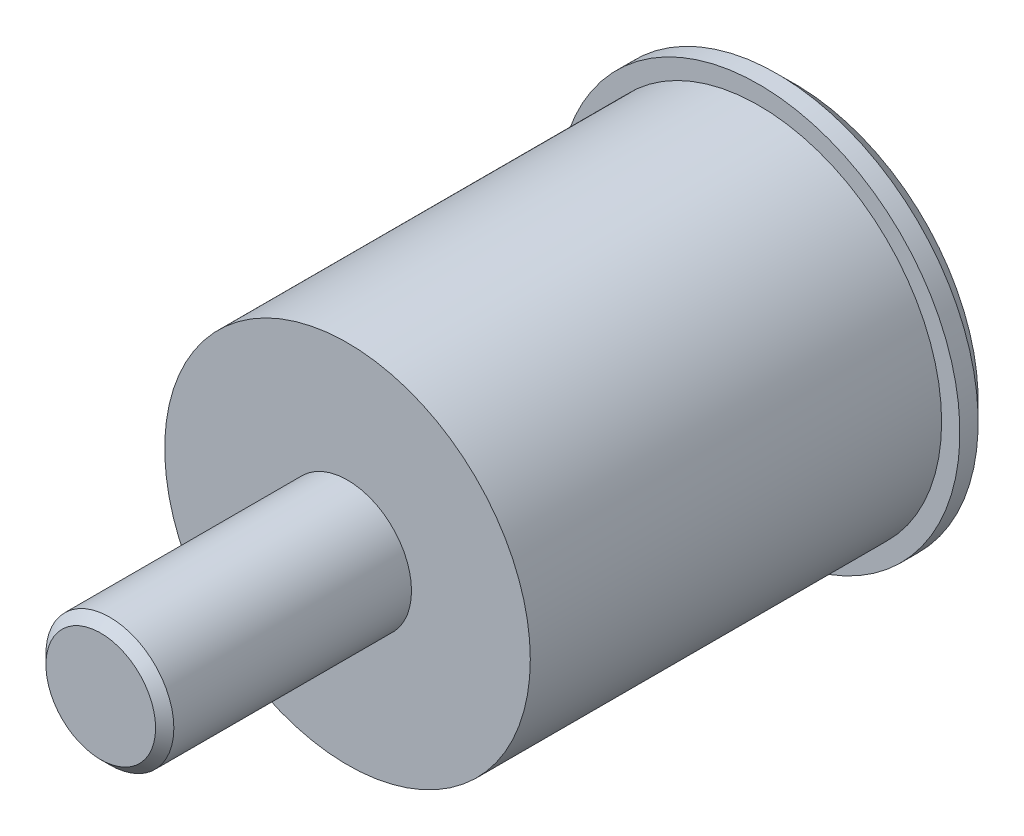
ISO-10303-21;
HEADER;
FILE_DESCRIPTION(('STEP AP214'),'2;1');
FILE_NAME('part.step','',(''),(''),'','','');
FILE_SCHEMA(('AUTOMOTIVE_DESIGN { 1 0 10303 214 1 1 1 1 }'));
ENDSEC;
DATA;
#1=APPLICATION_CONTEXT('core data for automotive mechanical design processes');
#2=APPLICATION_PROTOCOL_DEFINITION('international standard','automotive_design',2000,#1);
#3=PRODUCT_CONTEXT('',#1,'mechanical');
#4=PRODUCT('Part','Part','',(#3));
#5=PRODUCT_RELATED_PRODUCT_CATEGORY('part','',(#4));
#6=PRODUCT_DEFINITION_FORMATION('','',#4);
#7=PRODUCT_DEFINITION_CONTEXT('part definition',#1,'design');
#8=PRODUCT_DEFINITION('design','',#6,#7);
#9=PRODUCT_DEFINITION_SHAPE('','',#8);
#10=(LENGTH_UNIT() NAMED_UNIT(*) SI_UNIT(.MILLI.,.METRE.));
#11=(NAMED_UNIT(*) PLANE_ANGLE_UNIT() SI_UNIT($,.RADIAN.));
#12=(NAMED_UNIT(*) SI_UNIT($,.STERADIAN.) SOLID_ANGLE_UNIT());
#13=UNCERTAINTY_MEASURE_WITH_UNIT(LENGTH_MEASURE(1.E-05),#10,'distance_accuracy_value','');
#14=(GEOMETRIC_REPRESENTATION_CONTEXT(3) GLOBAL_UNCERTAINTY_ASSIGNED_CONTEXT((#13)) GLOBAL_UNIT_ASSIGNED_CONTEXT((#10,
#11,#12)) REPRESENTATION_CONTEXT('',''));
#15=CARTESIAN_POINT('',(0.,0.,0.));
#16=DIRECTION('',(0.,0.,1.));
#17=DIRECTION('',(1.,0.,0.));
#18=AXIS2_PLACEMENT_3D('',#15,#16,#17);
#19=CARTESIAN_POINT('',(0.,0.,0.));
#20=DIRECTION('',(0.,0.,1.));
#21=DIRECTION('',(1.,0.,0.));
#22=AXIS2_PLACEMENT_3D('',#19,#20,#21);
#23=PLANE('',#22);
#24=CARTESIAN_POINT('',(0.,0.,0.));
#25=DIRECTION('',(0.,0.,1.));
#26=DIRECTION('',(1.,0.,0.));
#27=AXIS2_PLACEMENT_3D('',#24,#25,#26);
#28=CIRCLE('',#27,10.);
#29=CARTESIAN_POINT('',(10.,0.,0.));
#30=VERTEX_POINT('',#29);
#31=EDGE_CURVE('E113',#30,#30,#28,.T.);
#32=ORIENTED_EDGE('',*,*,#31,.T.);
#33=EDGE_LOOP('',(#32));
#34=FACE_BOUND('',#33,.T.);
#35=CARTESIAN_POINT('',(0.,0.,0.));
#36=DIRECTION('',(0.,0.,1.));
#37=DIRECTION('',(1.,0.,0.));
#38=AXIS2_PLACEMENT_3D('',#35,#36,#37);
#39=CIRCLE('',#38,3.5);
#40=CARTESIAN_POINT('',(3.5,0.,0.));
#41=VERTEX_POINT('',#40);
#42=EDGE_CURVE('E110',#41,#41,#39,.T.);
#43=ORIENTED_EDGE('',*,*,#42,.F.);
#44=EDGE_LOOP('',(#43));
#45=FACE_BOUND('',#44,.T.);
#46=ADVANCED_FACE('F24',(#34,#45),#23,.T.);
#47=CARTESIAN_POINT('',(0.,0.,-22.5));
#48=DIRECTION('',(0.,0.,1.));
#49=DIRECTION('',(1.,0.,0.));
#50=AXIS2_PLACEMENT_3D('',#47,#48,#49);
#51=CYLINDRICAL_SURFACE('',#50,10.);
#52=CARTESIAN_POINT('',(0.,0.,-22.5));
#53=DIRECTION('',(0.,0.,-1.));
#54=DIRECTION('',(-1.,0.,0.));
#55=AXIS2_PLACEMENT_3D('',#52,#53,#54);
#56=CIRCLE('',#55,10.);
#57=CARTESIAN_POINT('',(10.,0.,-22.5));
#58=VERTEX_POINT('',#57);
#59=EDGE_CURVE('E107',#58,#58,#56,.F.);
#60=CARTESIAN_POINT('',(10.,0.,-22.5));
#61=CARTESIAN_POINT('',(10.,0.,-22.265625));
#62=CARTESIAN_POINT('',(10.,0.,-22.03125));
#63=CARTESIAN_POINT('',(10.,0.,-21.5625));
#64=CARTESIAN_POINT('',(10.,0.,-21.328125));
#65=CARTESIAN_POINT('',(10.,0.,-20.859375));
#66=CARTESIAN_POINT('',(10.,0.,-20.625));
#67=CARTESIAN_POINT('',(10.,0.,-20.15625));
#68=CARTESIAN_POINT('',(10.,0.,-19.921875));
#69=CARTESIAN_POINT('',(10.,0.,-19.453125));
#70=CARTESIAN_POINT('',(10.,0.,-19.21875));
#71=CARTESIAN_POINT('',(10.,0.,-18.75));
#72=CARTESIAN_POINT('',(10.,0.,-18.515625));
#73=CARTESIAN_POINT('',(10.,0.,-18.046875));
#74=CARTESIAN_POINT('',(10.,0.,-17.8125));
#75=CARTESIAN_POINT('',(10.,0.,-17.34375));
#76=CARTESIAN_POINT('',(10.,0.,-17.109375));
#77=CARTESIAN_POINT('',(10.,0.,-16.640625));
#78=CARTESIAN_POINT('',(10.,0.,-16.40625));
#79=CARTESIAN_POINT('',(10.,0.,-15.9375));
#80=CARTESIAN_POINT('',(10.,0.,-15.703125));
#81=CARTESIAN_POINT('',(10.,0.,-15.234375));
#82=CARTESIAN_POINT('',(10.,0.,-15.));
#83=CARTESIAN_POINT('',(10.,0.,-14.53125));
#84=CARTESIAN_POINT('',(10.,0.,-14.296875));
#85=CARTESIAN_POINT('',(10.,0.,-13.828125));
#86=CARTESIAN_POINT('',(10.,0.,-13.59375));
#87=CARTESIAN_POINT('',(10.,0.,-13.125));
#88=CARTESIAN_POINT('',(10.,0.,-12.890625));
#89=CARTESIAN_POINT('',(10.,0.,-12.421875));
#90=CARTESIAN_POINT('',(10.,0.,-12.1875));
#91=CARTESIAN_POINT('',(10.,0.,-11.71875));
#92=CARTESIAN_POINT('',(10.,0.,-11.484375));
#93=CARTESIAN_POINT('',(10.,0.,-11.015625));
#94=CARTESIAN_POINT('',(10.,0.,-10.78125));
#95=CARTESIAN_POINT('',(10.,0.,-10.3125));
#96=CARTESIAN_POINT('',(10.,0.,-10.078125));
#97=CARTESIAN_POINT('',(10.,0.,-9.609375));
#98=CARTESIAN_POINT('',(10.,0.,-9.375));
#99=CARTESIAN_POINT('',(10.,0.,-8.90625));
#100=CARTESIAN_POINT('',(10.,0.,-8.671875));
#101=CARTESIAN_POINT('',(10.,0.,-8.203125));
#102=CARTESIAN_POINT('',(10.,0.,-7.96875));
#103=CARTESIAN_POINT('',(10.,0.,-7.5));
#104=CARTESIAN_POINT('',(10.,0.,-7.265625));
#105=CARTESIAN_POINT('',(10.,0.,-6.796875));
#106=CARTESIAN_POINT('',(10.,0.,-6.5625));
#107=CARTESIAN_POINT('',(10.,0.,-6.09375));
#108=CARTESIAN_POINT('',(10.,0.,-5.859375));
#109=CARTESIAN_POINT('',(10.,0.,-5.390625));
#110=CARTESIAN_POINT('',(10.,0.,-5.15625));
#111=CARTESIAN_POINT('',(10.,0.,-4.6875));
#112=CARTESIAN_POINT('',(10.,0.,-4.453125));
#113=CARTESIAN_POINT('',(10.,0.,-3.984375));
#114=CARTESIAN_POINT('',(10.,0.,-3.75));
#115=CARTESIAN_POINT('',(10.,0.,-3.28125));
#116=CARTESIAN_POINT('',(10.,0.,-3.046875));
#117=CARTESIAN_POINT('',(10.,0.,-2.578125));
#118=CARTESIAN_POINT('',(10.,0.,-2.34375));
#119=CARTESIAN_POINT('',(10.,0.,-1.875));
#120=CARTESIAN_POINT('',(10.,0.,-1.640625));
#121=CARTESIAN_POINT('',(10.,0.,-1.171875));
#122=CARTESIAN_POINT('',(10.,0.,-0.937500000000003));
#123=CARTESIAN_POINT('',(10.,0.,-0.468750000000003));
#124=CARTESIAN_POINT('',(10.,0.,-0.234375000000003));
#125=CARTESIAN_POINT('',(10.,0.,0.));
#126=B_SPLINE_CURVE_WITH_KNOTS('',3,(#60,#61,#62,#63,#64,#65,#66,#67,#68,#69,#70,#71,#72,#73,
#74,#75,#76,#77,#78,#79,#80,#81,#82,#83,#84,#85,#86,#87,#88,#89,#90,#91,#92,#93,#94,#95,#96,#97,
#98,#99,#100,#101,#102,#103,#104,#105,#106,#107,#108,#109,#110,#111,#112,#113,#114,#115,#116,
#117,#118,#119,#120,#121,#122,#123,#124,#125),.UNSPECIFIED.,.F.,.F.,(4,2,2,2,2,2,2,2,2,2,2,2,2,
2,2,2,2,2,2,2,2,2,2,2,2,2,2,2,2,2,2,2,4),(0.,0.703124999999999,1.40625,2.109375,2.8125,3.515625,
4.21875,4.921875,5.62499999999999,6.328125,7.03125,7.73437499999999,8.43749999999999,
9.14062499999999,9.84374999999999,10.546875,11.25,11.953125,12.65625,13.359375,14.0625,
14.765625,15.46875,16.171875,16.875,17.578125,18.28125,18.984375,19.6875,20.390625,21.09375,
21.796875,22.5),.UNSPECIFIED.);
#127=EDGE_CURVE('BSEAM26',#58,#30,#126,.T.);
#128=ORIENTED_EDGE('',*,*,#59,.T.);
#129=ORIENTED_EDGE('',*,*,#31,.F.);
#130=ORIENTED_EDGE('',*,*,#127,.T.);
#131=ORIENTED_EDGE('',*,*,#127,.F.);
#132=EDGE_LOOP('',(#128,#130,#129,#131));
#133=FACE_BOUND('',#132,.T.);
#134=ADVANCED_FACE('F26',(#133),#51,.T.);
#135=CARTESIAN_POINT('',(0.,0.,13.5));
#136=DIRECTION('',(0.,0.,-1.));
#137=DIRECTION('',(-1.,0.,0.));
#138=AXIS2_PLACEMENT_3D('',#135,#136,#137);
#139=CYLINDRICAL_SURFACE('',#138,3.5);
#140=CARTESIAN_POINT('',(0.,0.,13.));
#141=DIRECTION('',(0.,0.,1.));
#142=DIRECTION('',(1.,0.,0.));
#143=AXIS2_PLACEMENT_3D('',#140,#141,#142);
#144=CIRCLE('',#143,3.5);
#145=CARTESIAN_POINT('',(3.5,0.,13.));
#146=VERTEX_POINT('',#145);
#147=EDGE_CURVE('E11',#146,#146,#144,.F.);
#148=ORIENTED_EDGE('',*,*,#147,.T.);
#149=EDGE_LOOP('',(#148));
#150=FACE_BOUND('',#149,.T.);
#151=ORIENTED_EDGE('',*,*,#42,.T.);
#152=EDGE_LOOP('',(#151));
#153=FACE_BOUND('',#152,.T.);
#154=ADVANCED_FACE('F142',(#150,#153),#139,.T.);
#155=CARTESIAN_POINT('',(0.,0.,13.5));
#156=DIRECTION('',(0.,0.,1.));
#157=DIRECTION('',(1.,0.,0.));
#158=AXIS2_PLACEMENT_3D('',#155,#156,#157);
#159=PLANE('',#158);
#160=CARTESIAN_POINT('',(0.,0.,13.5));
#161=DIRECTION('',(0.,0.,1.));
#162=DIRECTION('',(1.,0.,0.));
#163=AXIS2_PLACEMENT_3D('',#160,#161,#162);
#164=CIRCLE('',#163,3.);
#165=CARTESIAN_POINT('',(3.,0.,13.5));
#166=VERTEX_POINT('',#165);
#167=EDGE_CURVE('E32',#166,#166,#164,.T.);
#168=ORIENTED_EDGE('',*,*,#167,.T.);
#169=EDGE_LOOP('',(#168));
#170=FACE_BOUND('',#169,.T.);
#171=ADVANCED_FACE('F124',(#170),#159,.T.);
#172=CARTESIAN_POINT('',(0.,0.,-24.5));
#173=DIRECTION('',(0.,0.,1.));
#174=DIRECTION('',(1.,0.,0.));
#175=AXIS2_PLACEMENT_3D('',#172,#173,#174);
#176=CYLINDRICAL_SURFACE('',#175,11.);
#177=CARTESIAN_POINT('',(0.,0.,-23.5));
#178=DIRECTION('',(0.,0.,-1.));
#179=DIRECTION('',(-1.,0.,0.));
#180=AXIS2_PLACEMENT_3D('',#177,#178,#179);
#181=CIRCLE('',#180,11.);
#182=CARTESIAN_POINT('',(-11.,0.,-23.5));
#183=VERTEX_POINT('',#182);
#184=EDGE_CURVE('E119',#183,#183,#181,.F.);
#185=ORIENTED_EDGE('',*,*,#184,.T.);
#186=EDGE_LOOP('',(#185));
#187=FACE_BOUND('',#186,.T.);
#188=CARTESIAN_POINT('',(0.,0.,-22.5));
#189=DIRECTION('',(0.,0.,-1.));
#190=DIRECTION('',(-1.,0.,0.));
#191=AXIS2_PLACEMENT_3D('',#188,#189,#190);
#192=CIRCLE('',#191,11.);
#193=CARTESIAN_POINT('',(-11.,0.,-22.5));
#194=VERTEX_POINT('',#193);
#195=EDGE_CURVE('E102',#194,#194,#192,.T.);
#196=ORIENTED_EDGE('',*,*,#195,.T.);
#197=EDGE_LOOP('',(#196));
#198=FACE_BOUND('',#197,.T.);
#199=ADVANCED_FACE('F151',(#187,#198),#176,.T.);
#200=CARTESIAN_POINT('',(0.,0.,-24.5));
#201=DIRECTION('',(0.,0.,-1.));
#202=DIRECTION('',(-1.,0.,0.));
#203=AXIS2_PLACEMENT_3D('',#200,#201,#202);
#204=PLANE('',#203);
#205=DIRECTION('',(0.,-1.,0.));
#206=VECTOR('',#205,1.);
#207=CARTESIAN_POINT('',(4.5,1.,-24.5));
#208=LINE('',#207,#206);
#209=CARTESIAN_POINT('',(4.5,1.,-24.5));
#210=VERTEX_POINT('',#209);
#211=CARTESIAN_POINT('',(4.5,-1.,-24.5));
#212=VERTEX_POINT('',#211);
#213=EDGE_CURVE('E39',#210,#212,#208,.T.);
#214=ORIENTED_EDGE('',*,*,#213,.F.);
#215=DIRECTION('',(1.,0.,0.));
#216=VECTOR('',#215,1.);
#217=CARTESIAN_POINT('',(4.5,1.,-24.5));
#218=LINE('',#217,#216);
#219=CARTESIAN_POINT('',(-4.5,1.,-24.5));
#220=VERTEX_POINT('',#219);
#221=EDGE_CURVE('E87',#220,#210,#218,.T.);
#222=ORIENTED_EDGE('',*,*,#221,.F.);
#223=DIRECTION('',(0.,1.,0.));
#224=VECTOR('',#223,1.);
#225=CARTESIAN_POINT('',(-4.5,1.,-24.5));
#226=LINE('',#225,#224);
#227=CARTESIAN_POINT('',(-4.5,-1.,-24.5));
#228=VERTEX_POINT('',#227);
#229=EDGE_CURVE('E70',#228,#220,#226,.T.);
#230=ORIENTED_EDGE('',*,*,#229,.F.);
#231=DIRECTION('',(-1.,0.,0.));
#232=VECTOR('',#231,1.);
#233=CARTESIAN_POINT('',(4.5,-1.,-24.5));
#234=LINE('',#233,#232);
#235=EDGE_CURVE('E81',#212,#228,#234,.T.);
#236=ORIENTED_EDGE('',*,*,#235,.F.);
#237=EDGE_LOOP('',(#214,#222,#230,#236));
#238=FACE_BOUND('',#237,.T.);
#239=CARTESIAN_POINT('',(0.,0.,-24.5));
#240=DIRECTION('',(0.,0.,-1.));
#241=DIRECTION('',(-1.,0.,0.));
#242=AXIS2_PLACEMENT_3D('',#239,#240,#241);
#243=CIRCLE('',#242,10.);
#244=CARTESIAN_POINT('',(-10.,0.,-24.5));
#245=VERTEX_POINT('',#244);
#246=EDGE_CURVE('E116',#245,#245,#243,.T.);
#247=ORIENTED_EDGE('',*,*,#246,.T.);
#248=EDGE_LOOP('',(#247));
#249=FACE_BOUND('',#248,.T.);
#250=ADVANCED_FACE('F85',(#238,#249),#204,.T.);
#251=CARTESIAN_POINT('',(0.,0.,-22.5));
#252=DIRECTION('',(0.,0.,-1.));
#253=DIRECTION('',(-1.,0.,0.));
#254=AXIS2_PLACEMENT_3D('',#251,#252,#253);
#255=PLANE('',#254);
#256=ORIENTED_EDGE('',*,*,#59,.F.);
#257=EDGE_LOOP('',(#256));
#258=FACE_BOUND('',#257,.T.);
#259=ORIENTED_EDGE('',*,*,#195,.F.);
#260=EDGE_LOOP('',(#259));
#261=FACE_BOUND('',#260,.T.);
#262=ADVANCED_FACE('F157',(#258,#261),#255,.F.);
#263=CARTESIAN_POINT('',(0.,0.,-24.5));
#264=DIRECTION('',(0.,0.,1.));
#265=DIRECTION('',(1.,0.,0.));
#266=AXIS2_PLACEMENT_3D('',#263,#264,#265);
#267=CONICAL_SURFACE('',#266,10.,0.785398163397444);
#268=ORIENTED_EDGE('',*,*,#184,.F.);
#269=EDGE_LOOP('',(#268));
#270=FACE_BOUND('',#269,.T.);
#271=ORIENTED_EDGE('',*,*,#246,.F.);
#272=EDGE_LOOP('',(#271));
#273=FACE_BOUND('',#272,.T.);
#274=ADVANCED_FACE('F160',(#270,#273),#267,.T.);
#275=CARTESIAN_POINT('',(4.5,1.,-4.5));
#276=DIRECTION('',(1.,0.,0.));
#277=DIRECTION('',(0.,0.,-1.));
#278=AXIS2_PLACEMENT_3D('',#275,#276,#277);
#279=PLANE('',#278);
#280=ORIENTED_EDGE('',*,*,#213,.T.);
#281=DIRECTION('',(0.,0.,-1.));
#282=VECTOR('',#281,1.);
#283=CARTESIAN_POINT('',(4.5,-1.,-4.5));
#284=LINE('',#283,#282);
#285=CARTESIAN_POINT('',(4.5,-1.,-4.5));
#286=VERTEX_POINT('',#285);
#287=EDGE_CURVE('E78',#286,#212,#284,.T.);
#288=ORIENTED_EDGE('',*,*,#287,.F.);
#289=DIRECTION('',(0.,-1.,0.));
#290=VECTOR('',#289,1.);
#291=CARTESIAN_POINT('',(4.5,1.,-4.5));
#292=LINE('',#291,#290);
#293=CARTESIAN_POINT('',(4.5,1.,-4.5));
#294=VERTEX_POINT('',#293);
#295=EDGE_CURVE('E89',#294,#286,#292,.T.);
#296=ORIENTED_EDGE('',*,*,#295,.F.);
#297=DIRECTION('',(0.,0.,-1.));
#298=VECTOR('',#297,1.);
#299=CARTESIAN_POINT('',(4.5,1.,-4.5));
#300=LINE('',#299,#298);
#301=EDGE_CURVE('E46',#294,#210,#300,.T.);
#302=ORIENTED_EDGE('',*,*,#301,.T.);
#303=EDGE_LOOP('',(#280,#288,#296,#302));
#304=FACE_BOUND('',#303,.T.);
#305=ADVANCED_FACE('F164',(#304),#279,.F.);
#306=CARTESIAN_POINT('',(4.5,1.,-4.5));
#307=DIRECTION('',(0.,1.,0.));
#308=DIRECTION('',(-1.,0.,0.));
#309=AXIS2_PLACEMENT_3D('',#306,#307,#308);
#310=PLANE('',#309);
#311=ORIENTED_EDGE('',*,*,#221,.T.);
#312=ORIENTED_EDGE('',*,*,#301,.F.);
#313=DIRECTION('',(1.,0.,0.));
#314=VECTOR('',#313,1.);
#315=CARTESIAN_POINT('',(4.5,1.,-4.5));
#316=LINE('',#315,#314);
#317=CARTESIAN_POINT('',(-4.5,1.,-4.5));
#318=VERTEX_POINT('',#317);
#319=EDGE_CURVE('E98',#318,#294,#316,.T.);
#320=ORIENTED_EDGE('',*,*,#319,.F.);
#321=DIRECTION('',(0.,0.,-1.));
#322=VECTOR('',#321,1.);
#323=CARTESIAN_POINT('',(-4.5,1.,-4.5));
#324=LINE('',#323,#322);
#325=EDGE_CURVE('E77',#318,#220,#324,.T.);
#326=ORIENTED_EDGE('',*,*,#325,.T.);
#327=EDGE_LOOP('',(#311,#312,#320,#326));
#328=FACE_BOUND('',#327,.T.);
#329=ADVANCED_FACE('F168',(#328),#310,.F.);
#330=CARTESIAN_POINT('',(-4.5,1.,-4.5));
#331=DIRECTION('',(-1.,0.,0.));
#332=DIRECTION('',(0.,-1.,0.));
#333=AXIS2_PLACEMENT_3D('',#330,#331,#332);
#334=PLANE('',#333);
#335=ORIENTED_EDGE('',*,*,#229,.T.);
#336=ORIENTED_EDGE('',*,*,#325,.F.);
#337=DIRECTION('',(0.,1.,0.));
#338=VECTOR('',#337,1.);
#339=CARTESIAN_POINT('',(-4.5,1.,-4.5));
#340=LINE('',#339,#338);
#341=CARTESIAN_POINT('',(-4.5,-1.,-4.5));
#342=VERTEX_POINT('',#341);
#343=EDGE_CURVE('E73',#342,#318,#340,.T.);
#344=ORIENTED_EDGE('',*,*,#343,.F.);
#345=DIRECTION('',(0.,0.,-1.));
#346=VECTOR('',#345,1.);
#347=CARTESIAN_POINT('',(-4.5,-1.,-4.5));
#348=LINE('',#347,#346);
#349=EDGE_CURVE('E66',#342,#228,#348,.T.);
#350=ORIENTED_EDGE('',*,*,#349,.T.);
#351=EDGE_LOOP('',(#335,#336,#344,#350));
#352=FACE_BOUND('',#351,.T.);
#353=ADVANCED_FACE('F68',(#352),#334,.F.);
#354=CARTESIAN_POINT('',(4.5,-1.,-4.5));
#355=DIRECTION('',(0.,-1.,0.));
#356=DIRECTION('',(1.,0.,0.));
#357=AXIS2_PLACEMENT_3D('',#354,#355,#356);
#358=PLANE('',#357);
#359=ORIENTED_EDGE('',*,*,#235,.T.);
#360=ORIENTED_EDGE('',*,*,#349,.F.);
#361=DIRECTION('',(-1.,0.,0.));
#362=VECTOR('',#361,1.);
#363=CARTESIAN_POINT('',(4.5,-1.,-4.5));
#364=LINE('',#363,#362);
#365=EDGE_CURVE('E95',#286,#342,#364,.T.);
#366=ORIENTED_EDGE('',*,*,#365,.F.);
#367=ORIENTED_EDGE('',*,*,#287,.T.);
#368=EDGE_LOOP('',(#359,#360,#366,#367));
#369=FACE_BOUND('',#368,.T.);
#370=ADVANCED_FACE('F82',(#369),#358,.F.);
#371=CARTESIAN_POINT('',(4.5,-1.,-4.5));
#372=DIRECTION('',(0.,0.,-1.));
#373=DIRECTION('',(-1.,0.,0.));
#374=AXIS2_PLACEMENT_3D('',#371,#372,#373);
#375=PLANE('',#374);
#376=ORIENTED_EDGE('',*,*,#295,.T.);
#377=ORIENTED_EDGE('',*,*,#365,.T.);
#378=ORIENTED_EDGE('',*,*,#343,.T.);
#379=ORIENTED_EDGE('',*,*,#319,.T.);
#380=EDGE_LOOP('',(#376,#377,#378,#379));
#381=FACE_BOUND('',#380,.T.);
#382=ADVANCED_FACE('F128',(#381),#375,.T.);
#383=CARTESIAN_POINT('',(0.,0.,13.5));
#384=DIRECTION('',(0.,0.,-1.));
#385=DIRECTION('',(-1.,0.,0.));
#386=AXIS2_PLACEMENT_3D('',#383,#384,#385);
#387=CONICAL_SURFACE('',#386,3.,0.785398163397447);
#388=ORIENTED_EDGE('',*,*,#147,.F.);
#389=EDGE_LOOP('',(#388));
#390=FACE_BOUND('',#389,.T.);
#391=ORIENTED_EDGE('',*,*,#167,.F.);
#392=EDGE_LOOP('',(#391));
#393=FACE_BOUND('',#392,.T.);
#394=ADVANCED_FACE('F126',(#390,#393),#387,.T.);
#395=CLOSED_SHELL('',(#46,#134,#154,#171,#199,#250,#262,#274,#305,#329,#353,#370,#382,#394));
#396=MANIFOLD_SOLID_BREP('B2',#395);
#397=ADVANCED_BREP_SHAPE_REPRESENTATION('',(#18,#396),#14);
#398=SHAPE_DEFINITION_REPRESENTATION(#9,#397);
ENDSEC;
END-ISO-10303-21;
